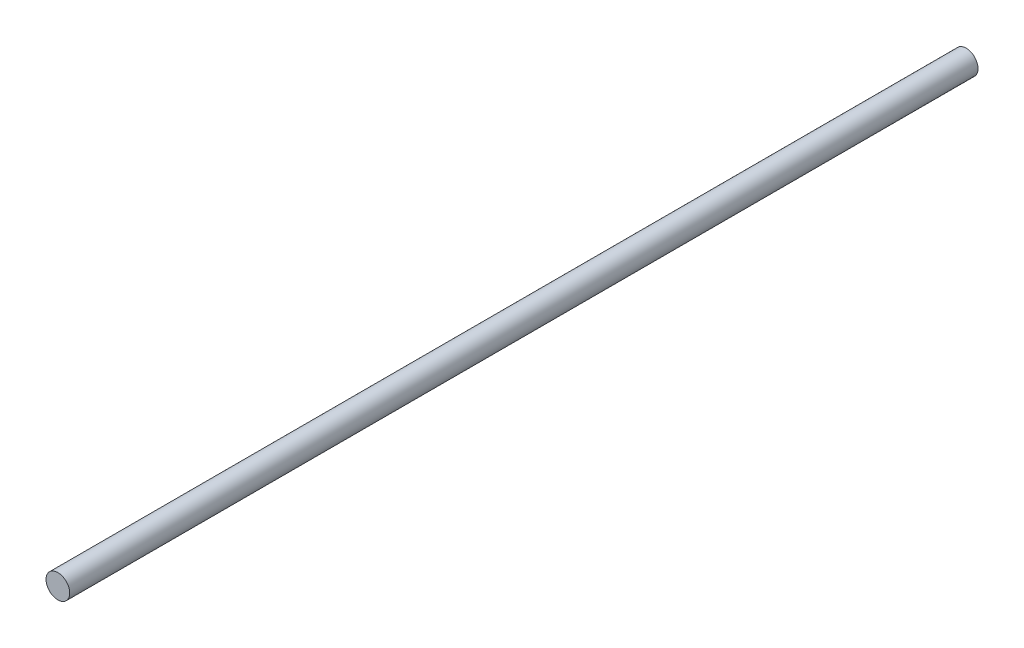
from build123d import *

# Parameters (mm, degrees)
SKETCH1_R          = 0.762
BASE_EXTRUDE_DEPTH = 58.42


with BuildPart() as part:
    # Sketch1 → Base-Extrude (new body)
    with BuildSketch(Plane.XY):
        with Locations(Location((0, 0, 0), (0, 0, 180))):
            Circle(SKETCH1_R)
    extrude(amount=BASE_EXTRUDE_DEPTH)


solid = part.part
